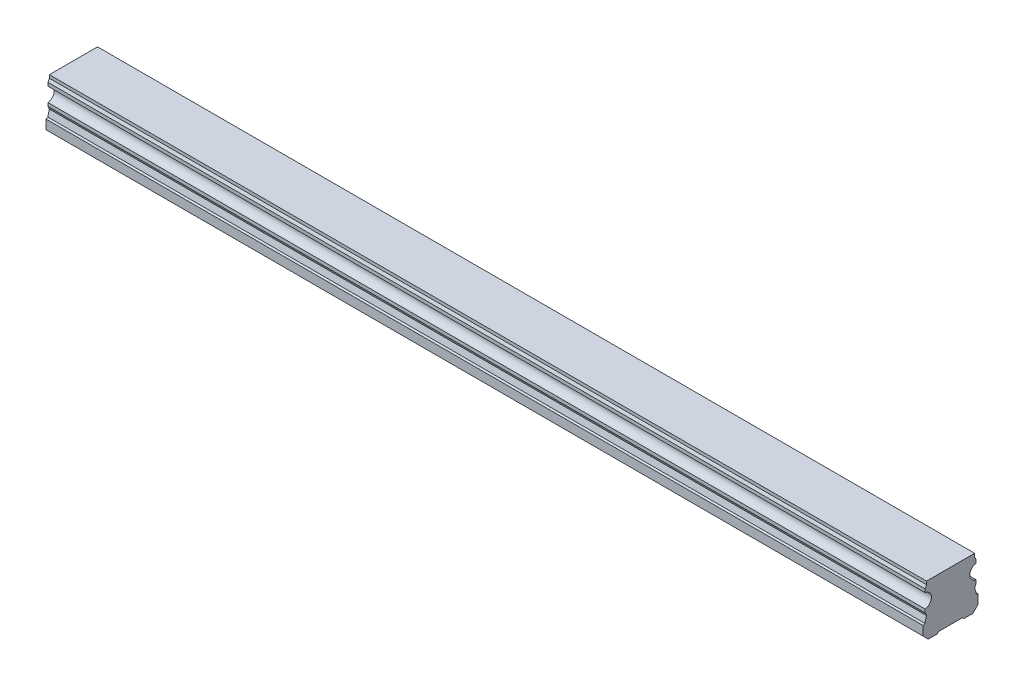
ISO-10303-21;
HEADER;
FILE_DESCRIPTION(('STEP AP214'),'2;1');
FILE_NAME('part.step','',(''),(''),'','','');
FILE_SCHEMA(('AUTOMOTIVE_DESIGN { 1 0 10303 214 1 1 1 1 }'));
ENDSEC;
DATA;
#1=APPLICATION_CONTEXT('core data for automotive mechanical design processes');
#2=APPLICATION_PROTOCOL_DEFINITION('international standard','automotive_design',2000,#1);
#3=PRODUCT_CONTEXT('',#1,'mechanical');
#4=PRODUCT('Part','Part','',(#3));
#5=PRODUCT_RELATED_PRODUCT_CATEGORY('part','',(#4));
#6=PRODUCT_DEFINITION_FORMATION('','',#4);
#7=PRODUCT_DEFINITION_CONTEXT('part definition',#1,'design');
#8=PRODUCT_DEFINITION('design','',#6,#7);
#9=PRODUCT_DEFINITION_SHAPE('','',#8);
#10=(LENGTH_UNIT() NAMED_UNIT(*) SI_UNIT(.MILLI.,.METRE.));
#11=(NAMED_UNIT(*) PLANE_ANGLE_UNIT() SI_UNIT($,.RADIAN.));
#12=(NAMED_UNIT(*) SI_UNIT($,.STERADIAN.) SOLID_ANGLE_UNIT());
#13=UNCERTAINTY_MEASURE_WITH_UNIT(LENGTH_MEASURE(1.E-05),#10,'distance_accuracy_value','');
#14=(GEOMETRIC_REPRESENTATION_CONTEXT(3) GLOBAL_UNCERTAINTY_ASSIGNED_CONTEXT((#13)) GLOBAL_UNIT_ASSIGNED_CONTEXT((#10,
#11,#12)) REPRESENTATION_CONTEXT('',''));
#15=CARTESIAN_POINT('',(0.,0.,0.));
#16=DIRECTION('',(0.,0.,1.));
#17=DIRECTION('',(1.,0.,0.));
#18=AXIS2_PLACEMENT_3D('',#15,#16,#17);
#19=CARTESIAN_POINT('',(210.,0.399999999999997,0.));
#20=DIRECTION('',(0.,-1.,0.));
#21=DIRECTION('',(0.,0.,-1.));
#22=AXIS2_PLACEMENT_3D('',#19,#20,#21);
#23=CONICAL_SURFACE('',#22,2.89999999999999,0.785398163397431);
#24=CARTESIAN_POINT('',(210.,0.799999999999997,0.));
#25=DIRECTION('',(0.,1.,0.));
#26=DIRECTION('',(0.,0.,1.));
#27=AXIS2_PLACEMENT_3D('',#24,#25,#26);
#28=CIRCLE('',#27,2.5);
#29=CARTESIAN_POINT('',(210.,0.799999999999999,2.5));
#30=VERTEX_POINT('',#29);
#31=EDGE_CURVE('E11',#30,#30,#28,.F.);
#32=ORIENTED_EDGE('',*,*,#31,.F.);
#33=EDGE_LOOP('',(#32));
#34=FACE_BOUND('',#33,.T.);
#35=CARTESIAN_POINT('',(210.,0.399999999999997,0.));
#36=DIRECTION('',(0.,1.,0.));
#37=DIRECTION('',(0.,0.,1.));
#38=AXIS2_PLACEMENT_3D('',#35,#36,#37);
#39=CIRCLE('',#38,2.89999999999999);
#40=CARTESIAN_POINT('',(210.,0.399999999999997,2.89999999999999));
#41=VERTEX_POINT('',#40);
#42=EDGE_CURVE('E444',#41,#41,#39,.T.);
#43=ORIENTED_EDGE('',*,*,#42,.F.);
#44=EDGE_LOOP('',(#43));
#45=FACE_BOUND('',#44,.T.);
#46=ADVANCED_FACE('F39',(#34,#45),#23,.F.);
#47=CARTESIAN_POINT('',(210.,7.,0.));
#48=DIRECTION('',(0.,-1.,0.));
#49=DIRECTION('',(0.,0.,-1.));
#50=AXIS2_PLACEMENT_3D('',#47,#48,#49);
#51=CYLINDRICAL_SURFACE('',#50,2.5);
#52=ORIENTED_EDGE('',*,*,#31,.T.);
#53=EDGE_LOOP('',(#52));
#54=FACE_BOUND('',#53,.T.);
#55=CARTESIAN_POINT('',(210.,7.,0.));
#56=DIRECTION('',(0.,-1.,0.));
#57=DIRECTION('',(0.,0.,-1.));
#58=AXIS2_PLACEMENT_3D('',#55,#56,#57);
#59=CIRCLE('',#58,2.5);
#60=CARTESIAN_POINT('',(210.,7.,-2.50000000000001));
#61=VERTEX_POINT('',#60);
#62=EDGE_CURVE('E49',#61,#61,#59,.T.);
#63=ORIENTED_EDGE('',*,*,#62,.F.);
#64=EDGE_LOOP('',(#63));
#65=FACE_BOUND('',#64,.T.);
#66=ADVANCED_FACE('F589',(#54,#65),#51,.F.);
#67=CARTESIAN_POINT('',(210.,7.,0.));
#68=DIRECTION('',(0.,-1.,0.));
#69=DIRECTION('',(0.,0.,-1.));
#70=AXIS2_PLACEMENT_3D('',#67,#68,#69);
#71=PLANE('',#70);
#72=CARTESIAN_POINT('',(210.,7.,0.));
#73=DIRECTION('',(0.,-1.,0.));
#74=DIRECTION('',(0.,0.,-1.));
#75=AXIS2_PLACEMENT_3D('',#72,#73,#74);
#76=CIRCLE('',#75,2.1);
#77=CARTESIAN_POINT('',(210.,7.,-2.1));
#78=VERTEX_POINT('',#77);
#79=EDGE_CURVE('E42',#78,#78,#76,.T.);
#80=ORIENTED_EDGE('',*,*,#79,.F.);
#81=EDGE_LOOP('',(#80));
#82=FACE_BOUND('',#81,.T.);
#83=ORIENTED_EDGE('',*,*,#62,.T.);
#84=EDGE_LOOP('',(#83));
#85=FACE_BOUND('',#84,.T.);
#86=ADVANCED_FACE('F594',(#82,#85),#71,.T.);
#87=CARTESIAN_POINT('',(150.,0.399999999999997,0.));
#88=DIRECTION('',(0.,-1.,0.));
#89=DIRECTION('',(0.,0.,-1.));
#90=AXIS2_PLACEMENT_3D('',#87,#88,#89);
#91=CONICAL_SURFACE('',#90,2.89999999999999,0.785398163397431);
#92=CARTESIAN_POINT('',(150.,0.799999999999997,0.));
#93=DIRECTION('',(0.,1.,0.));
#94=DIRECTION('',(0.,0.,1.));
#95=AXIS2_PLACEMENT_3D('',#92,#93,#94);
#96=CIRCLE('',#95,2.5);
#97=CARTESIAN_POINT('',(150.,0.799999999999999,2.5));
#98=VERTEX_POINT('',#97);
#99=EDGE_CURVE('E440',#98,#98,#96,.F.);
#100=ORIENTED_EDGE('',*,*,#99,.F.);
#101=EDGE_LOOP('',(#100));
#102=FACE_BOUND('',#101,.T.);
#103=CARTESIAN_POINT('',(150.,0.399999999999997,0.));
#104=DIRECTION('',(0.,1.,0.));
#105=DIRECTION('',(0.,0.,1.));
#106=AXIS2_PLACEMENT_3D('',#103,#104,#105);
#107=CIRCLE('',#106,2.89999999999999);
#108=CARTESIAN_POINT('',(150.,0.399999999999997,2.89999999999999));
#109=VERTEX_POINT('',#108);
#110=EDGE_CURVE('E432',#109,#109,#107,.T.);
#111=ORIENTED_EDGE('',*,*,#110,.F.);
#112=EDGE_LOOP('',(#111));
#113=FACE_BOUND('',#112,.T.);
#114=ADVANCED_FACE('F681',(#102,#113),#91,.F.);
#115=CARTESIAN_POINT('',(150.,7.,0.));
#116=DIRECTION('',(0.,-1.,0.));
#117=DIRECTION('',(0.,0.,-1.));
#118=AXIS2_PLACEMENT_3D('',#115,#116,#117);
#119=CYLINDRICAL_SURFACE('',#118,2.5);
#120=ORIENTED_EDGE('',*,*,#99,.T.);
#121=EDGE_LOOP('',(#120));
#122=FACE_BOUND('',#121,.T.);
#123=CARTESIAN_POINT('',(150.,7.,0.));
#124=DIRECTION('',(0.,-1.,0.));
#125=DIRECTION('',(0.,0.,-1.));
#126=AXIS2_PLACEMENT_3D('',#123,#124,#125);
#127=CIRCLE('',#126,2.5);
#128=CARTESIAN_POINT('',(150.,7.,-2.50000000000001));
#129=VERTEX_POINT('',#128);
#130=EDGE_CURVE('E436',#129,#129,#127,.T.);
#131=ORIENTED_EDGE('',*,*,#130,.F.);
#132=EDGE_LOOP('',(#131));
#133=FACE_BOUND('',#132,.T.);
#134=ADVANCED_FACE('F677',(#122,#133),#119,.F.);
#135=CARTESIAN_POINT('',(150.,7.,0.));
#136=DIRECTION('',(0.,-1.,0.));
#137=DIRECTION('',(0.,0.,-1.));
#138=AXIS2_PLACEMENT_3D('',#135,#136,#137);
#139=PLANE('',#138);
#140=CARTESIAN_POINT('',(150.,7.,0.));
#141=DIRECTION('',(0.,-1.,0.));
#142=DIRECTION('',(0.,0.,-1.));
#143=AXIS2_PLACEMENT_3D('',#140,#141,#142);
#144=CIRCLE('',#143,2.1);
#145=CARTESIAN_POINT('',(150.,7.,-2.1));
#146=VERTEX_POINT('',#145);
#147=EDGE_CURVE('E454',#146,#146,#144,.T.);
#148=ORIENTED_EDGE('',*,*,#147,.F.);
#149=EDGE_LOOP('',(#148));
#150=FACE_BOUND('',#149,.T.);
#151=ORIENTED_EDGE('',*,*,#130,.T.);
#152=EDGE_LOOP('',(#151));
#153=FACE_BOUND('',#152,.T.);
#154=ADVANCED_FACE('F667',(#150,#153),#139,.T.);
#155=CARTESIAN_POINT('',(240.,14.,-6.59000000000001));
#156=DIRECTION('',(0.,0.,1.));
#157=DIRECTION('',(0.,-1.,0.));
#158=AXIS2_PLACEMENT_3D('',#155,#156,#157);
#159=PLANE('',#158);
#160=DIRECTION('',(0.,1.,0.));
#161=VECTOR('',#160,1.);
#162=CARTESIAN_POINT('',(0.,14.,-6.59000000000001));
#163=LINE('',#162,#161);
#164=CARTESIAN_POINT('',(0.,13.15,-6.59));
#165=VERTEX_POINT('',#164);
#166=CARTESIAN_POINT('',(0.,14.,-6.59000000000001));
#167=VERTEX_POINT('',#166);
#168=EDGE_CURVE('E255',#165,#167,#163,.T.);
#169=ORIENTED_EDGE('',*,*,#168,.T.);
#170=DIRECTION('',(-1.,0.,0.));
#171=VECTOR('',#170,1.);
#172=CARTESIAN_POINT('',(240.,14.,-6.59000000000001));
#173=LINE('',#172,#171);
#174=CARTESIAN_POINT('',(240.,14.,-6.59000000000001));
#175=VERTEX_POINT('',#174);
#176=EDGE_CURVE('E421',#175,#167,#173,.T.);
#177=ORIENTED_EDGE('',*,*,#176,.F.);
#178=DIRECTION('',(0.,1.,0.));
#179=VECTOR('',#178,1.);
#180=CARTESIAN_POINT('',(240.,14.,-6.59000000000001));
#181=LINE('',#180,#179);
#182=CARTESIAN_POINT('',(240.,13.15,-6.59));
#183=VERTEX_POINT('',#182);
#184=EDGE_CURVE('E331',#183,#175,#181,.T.);
#185=ORIENTED_EDGE('',*,*,#184,.F.);
#186=DIRECTION('',(-1.,0.,0.));
#187=VECTOR('',#186,1.);
#188=CARTESIAN_POINT('',(240.,13.15,-6.59));
#189=LINE('',#188,#187);
#190=EDGE_CURVE('E251',#183,#165,#189,.T.);
#191=ORIENTED_EDGE('',*,*,#190,.T.);
#192=EDGE_LOOP('',(#169,#177,#185,#191));
#193=FACE_BOUND('',#192,.T.);
#194=ADVANCED_FACE('F664',(#193),#159,.F.);
#195=CARTESIAN_POINT('',(240.,14.,-6.59000000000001));
#196=DIRECTION('',(0.,-1.,0.));
#197=DIRECTION('',(0.,0.,-1.));
#198=AXIS2_PLACEMENT_3D('',#195,#196,#197);
#199=PLANE('',#198);
#200=DIRECTION('',(0.,0.,1.));
#201=VECTOR('',#200,1.);
#202=CARTESIAN_POINT('',(0.,14.,-6.59000000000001));
#203=LINE('',#202,#201);
#204=CARTESIAN_POINT('',(0.,14.,6.59));
#205=VERTEX_POINT('',#204);
#206=EDGE_CURVE('E259',#167,#205,#203,.T.);
#207=ORIENTED_EDGE('',*,*,#206,.T.);
#208=DIRECTION('',(-1.,0.,0.));
#209=VECTOR('',#208,1.);
#210=CARTESIAN_POINT('',(240.,14.,6.59));
#211=LINE('',#210,#209);
#212=CARTESIAN_POINT('',(240.,14.,6.59));
#213=VERTEX_POINT('',#212);
#214=EDGE_CURVE('E417',#213,#205,#211,.T.);
#215=ORIENTED_EDGE('',*,*,#214,.F.);
#216=DIRECTION('',(0.,0.,1.));
#217=VECTOR('',#216,1.);
#218=CARTESIAN_POINT('',(240.,14.,-6.59000000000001));
#219=LINE('',#218,#217);
#220=EDGE_CURVE('E157',#175,#213,#219,.T.);
#221=ORIENTED_EDGE('',*,*,#220,.F.);
#222=ORIENTED_EDGE('',*,*,#176,.T.);
#223=EDGE_LOOP('',(#207,#215,#221,#222));
#224=FACE_BOUND('',#223,.T.);
#225=ADVANCED_FACE('F660',(#224),#199,.F.);
#226=CARTESIAN_POINT('',(240.,14.,6.59));
#227=DIRECTION('',(0.,0.,-1.));
#228=DIRECTION('',(0.,1.,0.));
#229=AXIS2_PLACEMENT_3D('',#226,#227,#228);
#230=PLANE('',#229);
#231=DIRECTION('',(0.,-1.,0.));
#232=VECTOR('',#231,1.);
#233=CARTESIAN_POINT('',(0.,14.,6.59));
#234=LINE('',#233,#232);
#235=CARTESIAN_POINT('',(0.,13.15,6.59));
#236=VERTEX_POINT('',#235);
#237=EDGE_CURVE('E262',#205,#236,#234,.T.);
#238=ORIENTED_EDGE('',*,*,#237,.T.);
#239=DIRECTION('',(-1.,0.,0.));
#240=VECTOR('',#239,1.);
#241=CARTESIAN_POINT('',(240.,13.15,6.59));
#242=LINE('',#241,#240);
#243=CARTESIAN_POINT('',(240.,13.15,6.59));
#244=VERTEX_POINT('',#243);
#245=EDGE_CURVE('E413',#244,#236,#242,.T.);
#246=ORIENTED_EDGE('',*,*,#245,.F.);
#247=DIRECTION('',(0.,-1.,0.));
#248=VECTOR('',#247,1.);
#249=CARTESIAN_POINT('',(240.,14.,6.59));
#250=LINE('',#249,#248);
#251=EDGE_CURVE('E497',#213,#244,#250,.T.);
#252=ORIENTED_EDGE('',*,*,#251,.F.);
#253=ORIENTED_EDGE('',*,*,#214,.T.);
#254=EDGE_LOOP('',(#238,#246,#252,#253));
#255=FACE_BOUND('',#254,.T.);
#256=ADVANCED_FACE('F656',(#255),#230,.F.);
#257=CARTESIAN_POINT('',(240.,13.15,6.59));
#258=DIRECTION('',(0.,-0.422618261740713,-0.906307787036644));
#259=DIRECTION('',(0.,0.906307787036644,-0.422618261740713));
#260=AXIS2_PLACEMENT_3D('',#257,#258,#259);
#261=PLANE('',#260);
#262=DIRECTION('',(0.,-0.906307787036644,0.422618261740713));
#263=VECTOR('',#262,1.);
#264=CARTESIAN_POINT('',(0.,13.15,6.59));
#265=LINE('',#264,#263);
#266=CARTESIAN_POINT('',(0.,12.3565324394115,6.96));
#267=VERTEX_POINT('',#266);
#268=EDGE_CURVE('E265',#236,#267,#265,.T.);
#269=ORIENTED_EDGE('',*,*,#268,.T.);
#270=DIRECTION('',(-1.,0.,0.));
#271=VECTOR('',#270,1.);
#272=CARTESIAN_POINT('',(240.,12.3565324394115,6.96));
#273=LINE('',#272,#271);
#274=CARTESIAN_POINT('',(240.,12.3565324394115,6.96));
#275=VERTEX_POINT('',#274);
#276=EDGE_CURVE('E409',#275,#267,#273,.T.);
#277=ORIENTED_EDGE('',*,*,#276,.F.);
#278=DIRECTION('',(0.,-0.906307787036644,0.422618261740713));
#279=VECTOR('',#278,1.);
#280=CARTESIAN_POINT('',(240.,13.15,6.59));
#281=LINE('',#280,#279);
#282=EDGE_CURVE('E500',#244,#275,#281,.T.);
#283=ORIENTED_EDGE('',*,*,#282,.F.);
#284=ORIENTED_EDGE('',*,*,#245,.T.);
#285=EDGE_LOOP('',(#269,#277,#283,#284));
#286=FACE_BOUND('',#285,.T.);
#287=ADVANCED_FACE('F652',(#286),#261,.F.);
#288=CARTESIAN_POINT('',(240.,12.3565324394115,6.96));
#289=DIRECTION('',(0.,0.,-1.));
#290=DIRECTION('',(0.,1.,0.));
#291=AXIS2_PLACEMENT_3D('',#288,#289,#290);
#292=PLANE('',#291);
#293=DIRECTION('',(0.,-1.,0.));
#294=VECTOR('',#293,1.);
#295=CARTESIAN_POINT('',(0.,12.3565324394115,6.96));
#296=LINE('',#295,#294);
#297=CARTESIAN_POINT('',(0.,11.4351744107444,6.96));
#298=VERTEX_POINT('',#297);
#299=EDGE_CURVE('E268',#267,#298,#296,.T.);
#300=ORIENTED_EDGE('',*,*,#299,.T.);
#301=DIRECTION('',(-1.,0.,0.));
#302=VECTOR('',#301,1.);
#303=CARTESIAN_POINT('',(240.,11.4351744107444,6.96));
#304=LINE('',#303,#302);
#305=CARTESIAN_POINT('',(240.,11.4351744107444,6.96));
#306=VERTEX_POINT('',#305);
#307=EDGE_CURVE('E405',#306,#298,#304,.T.);
#308=ORIENTED_EDGE('',*,*,#307,.F.);
#309=DIRECTION('',(0.,-1.,0.));
#310=VECTOR('',#309,1.);
#311=CARTESIAN_POINT('',(240.,12.3565324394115,6.96));
#312=LINE('',#311,#310);
#313=EDGE_CURVE('E503',#275,#306,#312,.T.);
#314=ORIENTED_EDGE('',*,*,#313,.F.);
#315=ORIENTED_EDGE('',*,*,#276,.T.);
#316=EDGE_LOOP('',(#300,#308,#314,#315));
#317=FACE_BOUND('',#316,.T.);
#318=ADVANCED_FACE('F648',(#317),#292,.F.);
#319=CARTESIAN_POINT('',(240.,9.5,7.2));
#320=DIRECTION('',(-1.,0.,0.));
#321=DIRECTION('',(0.,0.,1.));
#322=AXIS2_PLACEMENT_3D('',#319,#320,#321);
#323=CYLINDRICAL_SURFACE('',#322,1.95);
#324=CARTESIAN_POINT('',(0.,9.5,7.2));
#325=DIRECTION('',(-1.,0.,0.));
#326=DIRECTION('',(0.,0.,-1.));
#327=AXIS2_PLACEMENT_3D('',#324,#325,#326);
#328=CIRCLE('',#327,1.95);
#329=CARTESIAN_POINT('',(0.,7.56482558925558,6.96));
#330=VERTEX_POINT('',#329);
#331=EDGE_CURVE('E271',#298,#330,#328,.T.);
#332=ORIENTED_EDGE('',*,*,#331,.T.);
#333=DIRECTION('',(-1.,0.,0.));
#334=VECTOR('',#333,1.);
#335=CARTESIAN_POINT('',(240.,7.56482558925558,6.96));
#336=LINE('',#335,#334);
#337=CARTESIAN_POINT('',(240.,7.56482558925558,6.96));
#338=VERTEX_POINT('',#337);
#339=EDGE_CURVE('E401',#338,#330,#336,.T.);
#340=ORIENTED_EDGE('',*,*,#339,.F.);
#341=CARTESIAN_POINT('',(240.,9.5,7.2));
#342=DIRECTION('',(-1.,0.,0.));
#343=DIRECTION('',(0.,0.,-1.));
#344=AXIS2_PLACEMENT_3D('',#341,#342,#343);
#345=CIRCLE('',#344,1.95);
#346=EDGE_CURVE('E506',#306,#338,#345,.T.);
#347=ORIENTED_EDGE('',*,*,#346,.F.);
#348=ORIENTED_EDGE('',*,*,#307,.T.);
#349=EDGE_LOOP('',(#332,#340,#347,#348));
#350=FACE_BOUND('',#349,.T.);
#351=ADVANCED_FACE('F644',(#350),#323,.F.);
#352=CARTESIAN_POINT('',(240.,7.56482558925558,6.96));
#353=DIRECTION('',(0.,0.,-1.));
#354=DIRECTION('',(0.,1.,0.));
#355=AXIS2_PLACEMENT_3D('',#352,#353,#354);
#356=PLANE('',#355);
#357=DIRECTION('',(0.,-1.,0.));
#358=VECTOR('',#357,1.);
#359=CARTESIAN_POINT('',(0.,7.56482558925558,6.96));
#360=LINE('',#359,#358);
#361=CARTESIAN_POINT('',(0.,6.64346756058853,6.96));
#362=VERTEX_POINT('',#361);
#363=EDGE_CURVE('E274',#330,#362,#360,.T.);
#364=ORIENTED_EDGE('',*,*,#363,.T.);
#365=DIRECTION('',(-1.,0.,0.));
#366=VECTOR('',#365,1.);
#367=CARTESIAN_POINT('',(240.,6.64346756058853,6.96));
#368=LINE('',#367,#366);
#369=CARTESIAN_POINT('',(240.,6.64346756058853,6.96));
#370=VERTEX_POINT('',#369);
#371=EDGE_CURVE('E397',#370,#362,#368,.T.);
#372=ORIENTED_EDGE('',*,*,#371,.F.);
#373=DIRECTION('',(0.,-1.,0.));
#374=VECTOR('',#373,1.);
#375=CARTESIAN_POINT('',(240.,7.56482558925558,6.96));
#376=LINE('',#375,#374);
#377=EDGE_CURVE('E509',#338,#370,#376,.T.);
#378=ORIENTED_EDGE('',*,*,#377,.F.);
#379=ORIENTED_EDGE('',*,*,#339,.T.);
#380=EDGE_LOOP('',(#364,#372,#378,#379));
#381=FACE_BOUND('',#380,.T.);
#382=ADVANCED_FACE('F640',(#381),#356,.F.);
#383=CARTESIAN_POINT('',(240.,6.64346756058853,6.96));
#384=DIRECTION('',(0.,0.422618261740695,-0.906307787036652));
#385=DIRECTION('',(0.,0.906307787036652,0.422618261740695));
#386=AXIS2_PLACEMENT_3D('',#383,#384,#385);
#387=PLANE('',#386);
#388=DIRECTION('',(0.,-0.906307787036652,-0.422618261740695));
#389=VECTOR('',#388,1.);
#390=CARTESIAN_POINT('',(0.,6.64346756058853,6.96));
#391=LINE('',#390,#389);
#392=CARTESIAN_POINT('',(0.,5.85,6.59000000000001));
#393=VERTEX_POINT('',#392);
#394=EDGE_CURVE('E277',#362,#393,#391,.T.);
#395=ORIENTED_EDGE('',*,*,#394,.T.);
#396=DIRECTION('',(-1.,0.,0.));
#397=VECTOR('',#396,1.);
#398=CARTESIAN_POINT('',(240.,5.85,6.59000000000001));
#399=LINE('',#398,#397);
#400=CARTESIAN_POINT('',(240.,5.85,6.59000000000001));
#401=VERTEX_POINT('',#400);
#402=EDGE_CURVE('E393',#401,#393,#399,.T.);
#403=ORIENTED_EDGE('',*,*,#402,.F.);
#404=DIRECTION('',(0.,-0.906307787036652,-0.422618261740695));
#405=VECTOR('',#404,1.);
#406=CARTESIAN_POINT('',(240.,6.64346756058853,6.96));
#407=LINE('',#406,#405);
#408=EDGE_CURVE('E512',#370,#401,#407,.T.);
#409=ORIENTED_EDGE('',*,*,#408,.F.);
#410=ORIENTED_EDGE('',*,*,#371,.T.);
#411=EDGE_LOOP('',(#395,#403,#409,#410));
#412=FACE_BOUND('',#411,.T.);
#413=ADVANCED_FACE('F636',(#412),#387,.F.);
#414=CARTESIAN_POINT('',(240.,5.85,6.59000000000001));
#415=DIRECTION('',(0.,-0.25881904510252,-0.965925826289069));
#416=DIRECTION('',(0.,0.965925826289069,-0.25881904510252));
#417=AXIS2_PLACEMENT_3D('',#414,#415,#416);
#418=PLANE('',#417);
#419=DIRECTION('',(0.,-0.965925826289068,0.25881904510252));
#420=VECTOR('',#419,1.);
#421=CARTESIAN_POINT('',(0.,5.85,6.59000000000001));
#422=LINE('',#421,#420);
#423=CARTESIAN_POINT('',(0.,4.2,7.03211616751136));
#424=VERTEX_POINT('',#423);
#425=EDGE_CURVE('E280',#393,#424,#422,.T.);
#426=ORIENTED_EDGE('',*,*,#425,.T.);
#427=DIRECTION('',(-1.,0.,0.));
#428=VECTOR('',#427,1.);
#429=CARTESIAN_POINT('',(240.,4.2,7.03211616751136));
#430=LINE('',#429,#428);
#431=CARTESIAN_POINT('',(240.,4.2,7.03211616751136));
#432=VERTEX_POINT('',#431);
#433=EDGE_CURVE('E389',#432,#424,#430,.T.);
#434=ORIENTED_EDGE('',*,*,#433,.F.);
#435=DIRECTION('',(0.,-0.965925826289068,0.25881904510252));
#436=VECTOR('',#435,1.);
#437=CARTESIAN_POINT('',(240.,5.85,6.59000000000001));
#438=LINE('',#437,#436);
#439=EDGE_CURVE('E515',#401,#432,#438,.T.);
#440=ORIENTED_EDGE('',*,*,#439,.F.);
#441=ORIENTED_EDGE('',*,*,#402,.T.);
#442=EDGE_LOOP('',(#426,#434,#440,#441));
#443=FACE_BOUND('',#442,.T.);
#444=ADVANCED_FACE('F632',(#443),#418,.F.);
#445=CARTESIAN_POINT('',(240.,4.2,7.03211616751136));
#446=DIRECTION('',(0.,-0.866025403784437,-0.500000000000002));
#447=DIRECTION('',(0.,0.500000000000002,-0.866025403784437));
#448=AXIS2_PLACEMENT_3D('',#445,#446,#447);
#449=PLANE('',#448);
#450=DIRECTION('',(0.,-0.500000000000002,0.866025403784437));
#451=VECTOR('',#450,1.);
#452=CARTESIAN_POINT('',(0.,4.2,7.03211616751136));
#453=LINE('',#452,#451);
#454=CARTESIAN_POINT('',(0.,3.92986714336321,7.5));
#455=VERTEX_POINT('',#454);
#456=EDGE_CURVE('E283',#424,#455,#453,.T.);
#457=ORIENTED_EDGE('',*,*,#456,.T.);
#458=DIRECTION('',(-1.,0.,0.));
#459=VECTOR('',#458,1.);
#460=CARTESIAN_POINT('',(240.,3.92986714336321,7.5));
#461=LINE('',#460,#459);
#462=CARTESIAN_POINT('',(240.,3.92986714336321,7.5));
#463=VERTEX_POINT('',#462);
#464=EDGE_CURVE('E385',#463,#455,#461,.T.);
#465=ORIENTED_EDGE('',*,*,#464,.F.);
#466=DIRECTION('',(0.,-0.500000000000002,0.866025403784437));
#467=VECTOR('',#466,1.);
#468=CARTESIAN_POINT('',(240.,4.2,7.03211616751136));
#469=LINE('',#468,#467);
#470=EDGE_CURVE('E518',#432,#463,#469,.T.);
#471=ORIENTED_EDGE('',*,*,#470,.F.);
#472=ORIENTED_EDGE('',*,*,#433,.T.);
#473=EDGE_LOOP('',(#457,#465,#471,#472));
#474=FACE_BOUND('',#473,.T.);
#475=ADVANCED_FACE('F628',(#474),#449,.F.);
#476=CARTESIAN_POINT('',(240.,3.92986714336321,7.5));
#477=DIRECTION('',(0.,0.,-1.));
#478=DIRECTION('',(0.,1.,0.));
#479=AXIS2_PLACEMENT_3D('',#476,#477,#478);
#480=PLANE('',#479);
#481=DIRECTION('',(0.,-1.,0.));
#482=VECTOR('',#481,1.);
#483=CARTESIAN_POINT('',(0.,3.92986714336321,7.5));
#484=LINE('',#483,#482);
#485=CARTESIAN_POINT('',(0.,1.4,7.5));
#486=VERTEX_POINT('',#485);
#487=EDGE_CURVE('E286',#455,#486,#484,.T.);
#488=ORIENTED_EDGE('',*,*,#487,.T.);
#489=DIRECTION('',(-1.,0.,0.));
#490=VECTOR('',#489,1.);
#491=CARTESIAN_POINT('',(240.,1.4,7.5));
#492=LINE('',#491,#490);
#493=CARTESIAN_POINT('',(240.,1.4,7.5));
#494=VERTEX_POINT('',#493);
#495=EDGE_CURVE('E381',#494,#486,#492,.T.);
#496=ORIENTED_EDGE('',*,*,#495,.F.);
#497=DIRECTION('',(0.,-1.,0.));
#498=VECTOR('',#497,1.);
#499=CARTESIAN_POINT('',(240.,3.92986714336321,7.5));
#500=LINE('',#499,#498);
#501=EDGE_CURVE('E521',#463,#494,#500,.T.);
#502=ORIENTED_EDGE('',*,*,#501,.F.);
#503=ORIENTED_EDGE('',*,*,#464,.T.);
#504=EDGE_LOOP('',(#488,#496,#502,#503));
#505=FACE_BOUND('',#504,.T.);
#506=ADVANCED_FACE('F624',(#505),#480,.F.);
#507=CARTESIAN_POINT('',(240.,1.4,7.5));
#508=DIRECTION('',(0.,0.70710678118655,-0.707106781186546));
#509=DIRECTION('',(0.,0.707106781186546,0.70710678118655));
#510=AXIS2_PLACEMENT_3D('',#507,#508,#509);
#511=PLANE('',#510);
#512=DIRECTION('',(0.,-0.707106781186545,-0.70710678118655));
#513=VECTOR('',#512,1.);
#514=CARTESIAN_POINT('',(0.,1.4,7.5));
#515=LINE('',#514,#513);
#516=CARTESIAN_POINT('',(0.,0.,6.1));
#517=VERTEX_POINT('',#516);
#518=EDGE_CURVE('E289',#486,#517,#515,.T.);
#519=ORIENTED_EDGE('',*,*,#518,.T.);
#520=DIRECTION('',(-1.,0.,0.));
#521=VECTOR('',#520,1.);
#522=CARTESIAN_POINT('',(240.,0.,6.1));
#523=LINE('',#522,#521);
#524=CARTESIAN_POINT('',(240.,0.,6.1));
#525=VERTEX_POINT('',#524);
#526=EDGE_CURVE('E377',#525,#517,#523,.T.);
#527=ORIENTED_EDGE('',*,*,#526,.F.);
#528=DIRECTION('',(0.,-0.707106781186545,-0.70710678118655));
#529=VECTOR('',#528,1.);
#530=CARTESIAN_POINT('',(240.,1.4,7.5));
#531=LINE('',#530,#529);
#532=EDGE_CURVE('E524',#494,#525,#531,.T.);
#533=ORIENTED_EDGE('',*,*,#532,.F.);
#534=ORIENTED_EDGE('',*,*,#495,.T.);
#535=EDGE_LOOP('',(#519,#527,#533,#534));
#536=FACE_BOUND('',#535,.T.);
#537=ADVANCED_FACE('F620',(#536),#511,.F.);
#538=CARTESIAN_POINT('',(240.,0.,6.1));
#539=DIRECTION('',(0.,1.,0.));
#540=DIRECTION('',(0.,0.,1.));
#541=AXIS2_PLACEMENT_3D('',#538,#539,#540);
#542=PLANE('',#541);
#543=DIRECTION('',(0.,0.,-1.));
#544=VECTOR('',#543,1.);
#545=CARTESIAN_POINT('',(0.,0.,6.1));
#546=LINE('',#545,#544);
#547=CARTESIAN_POINT('',(0.,0.,3.65));
#548=VERTEX_POINT('',#547);
#549=EDGE_CURVE('E292',#517,#548,#546,.T.);
#550=ORIENTED_EDGE('',*,*,#549,.T.);
#551=DIRECTION('',(-1.,0.,0.));
#552=VECTOR('',#551,1.);
#553=CARTESIAN_POINT('',(240.,0.,3.65));
#554=LINE('',#553,#552);
#555=CARTESIAN_POINT('',(240.,0.,3.65));
#556=VERTEX_POINT('',#555);
#557=EDGE_CURVE('E373',#556,#548,#554,.T.);
#558=ORIENTED_EDGE('',*,*,#557,.F.);
#559=DIRECTION('',(0.,0.,-1.));
#560=VECTOR('',#559,1.);
#561=CARTESIAN_POINT('',(240.,0.,6.1));
#562=LINE('',#561,#560);
#563=EDGE_CURVE('E527',#525,#556,#562,.T.);
#564=ORIENTED_EDGE('',*,*,#563,.F.);
#565=ORIENTED_EDGE('',*,*,#526,.T.);
#566=EDGE_LOOP('',(#550,#558,#564,#565));
#567=FACE_BOUND('',#566,.T.);
#568=ADVANCED_FACE('F612',(#567),#542,.F.);
#569=CARTESIAN_POINT('',(240.,0.,3.65));
#570=DIRECTION('',(0.,0.707106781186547,0.707106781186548));
#571=DIRECTION('',(0.,-0.707106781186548,0.707106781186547));
#572=AXIS2_PLACEMENT_3D('',#569,#570,#571);
#573=PLANE('',#572);
#574=DIRECTION('',(0.,0.707106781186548,-0.707106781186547));
#575=VECTOR('',#574,1.);
#576=CARTESIAN_POINT('',(0.,0.,3.65));
#577=LINE('',#576,#575);
#578=CARTESIAN_POINT('',(0.,0.399999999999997,3.25));
#579=VERTEX_POINT('',#578);
#580=EDGE_CURVE('E295',#548,#579,#577,.T.);
#581=ORIENTED_EDGE('',*,*,#580,.T.);
#582=DIRECTION('',(-1.,0.,0.));
#583=VECTOR('',#582,1.);
#584=CARTESIAN_POINT('',(240.,0.399999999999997,3.25));
#585=LINE('',#584,#583);
#586=CARTESIAN_POINT('',(240.,0.399999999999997,3.25));
#587=VERTEX_POINT('',#586);
#588=EDGE_CURVE('E370',#587,#579,#585,.T.);
#589=ORIENTED_EDGE('',*,*,#588,.F.);
#590=DIRECTION('',(0.,0.707106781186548,-0.707106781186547));
#591=VECTOR('',#590,1.);
#592=CARTESIAN_POINT('',(240.,0.,3.65));
#593=LINE('',#592,#591);
#594=EDGE_CURVE('E530',#556,#587,#593,.T.);
#595=ORIENTED_EDGE('',*,*,#594,.F.);
#596=ORIENTED_EDGE('',*,*,#557,.T.);
#597=EDGE_LOOP('',(#581,#589,#595,#596));
#598=FACE_BOUND('',#597,.T.);
#599=ADVANCED_FACE('F603',(#598),#573,.F.);
#600=CARTESIAN_POINT('',(240.,0.399999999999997,3.25));
#601=DIRECTION('',(0.,1.,0.));
#602=DIRECTION('',(0.,0.,1.));
#603=AXIS2_PLACEMENT_3D('',#600,#601,#602);
#604=PLANE('',#603);
#605=CARTESIAN_POINT('',(90.,0.399999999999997,0.));
#606=DIRECTION('',(0.,1.,0.));
#607=DIRECTION('',(0.,0.,1.));
#608=AXIS2_PLACEMENT_3D('',#605,#606,#607);
#609=CIRCLE('',#608,2.89999999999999);
#610=CARTESIAN_POINT('',(90.,0.399999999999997,2.89999999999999));
#611=VERTEX_POINT('',#610);
#612=EDGE_CURVE('E462',#611,#611,#609,.T.);
#613=ORIENTED_EDGE('',*,*,#612,.T.);
#614=EDGE_LOOP('',(#613));
#615=FACE_BOUND('',#614,.T.);
#616=CARTESIAN_POINT('',(30.,0.399999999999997,0.));
#617=DIRECTION('',(0.,1.,0.));
#618=DIRECTION('',(0.,0.,1.));
#619=AXIS2_PLACEMENT_3D('',#616,#617,#618);
#620=CIRCLE('',#619,2.89999999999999);
#621=CARTESIAN_POINT('',(30.,0.399999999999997,2.89999999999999));
#622=VERTEX_POINT('',#621);
#623=EDGE_CURVE('E424',#622,#622,#620,.T.);
#624=ORIENTED_EDGE('',*,*,#623,.T.);
#625=EDGE_LOOP('',(#624));
#626=FACE_BOUND('',#625,.T.);
#627=DIRECTION('',(0.,0.,-1.));
#628=VECTOR('',#627,1.);
#629=CARTESIAN_POINT('',(0.,0.399999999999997,3.25));
#630=LINE('',#629,#628);
#631=CARTESIAN_POINT('',(0.,0.399999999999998,-3.25));
#632=VERTEX_POINT('',#631);
#633=EDGE_CURVE('E298',#579,#632,#630,.T.);
#634=ORIENTED_EDGE('',*,*,#633,.T.);
#635=DIRECTION('',(-1.,0.,0.));
#636=VECTOR('',#635,1.);
#637=CARTESIAN_POINT('',(240.,0.399999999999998,-3.25));
#638=LINE('',#637,#636);
#639=CARTESIAN_POINT('',(240.,0.399999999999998,-3.25));
#640=VERTEX_POINT('',#639);
#641=EDGE_CURVE('E366',#640,#632,#638,.T.);
#642=ORIENTED_EDGE('',*,*,#641,.F.);
#643=DIRECTION('',(0.,0.,-1.));
#644=VECTOR('',#643,1.);
#645=CARTESIAN_POINT('',(240.,0.399999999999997,3.25));
#646=LINE('',#645,#644);
#647=EDGE_CURVE('E533',#587,#640,#646,.T.);
#648=ORIENTED_EDGE('',*,*,#647,.F.);
#649=ORIENTED_EDGE('',*,*,#588,.T.);
#650=EDGE_LOOP('',(#634,#642,#648,#649));
#651=FACE_BOUND('',#650,.T.);
#652=ORIENTED_EDGE('',*,*,#110,.T.);
#653=EDGE_LOOP('',(#652));
#654=FACE_BOUND('',#653,.T.);
#655=ORIENTED_EDGE('',*,*,#42,.T.);
#656=EDGE_LOOP('',(#655));
#657=FACE_BOUND('',#656,.T.);
#658=ADVANCED_FACE('F600',(#615,#626,#651,#654,#657),#604,.F.);
#659=CARTESIAN_POINT('',(240.,0.399999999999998,-3.25));
#660=DIRECTION('',(0.,0.707106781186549,-0.707106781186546));
#661=DIRECTION('',(0.,0.707106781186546,0.707106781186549));
#662=AXIS2_PLACEMENT_3D('',#659,#660,#661);
#663=PLANE('',#662);
#664=DIRECTION('',(0.,-0.707106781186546,-0.707106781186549));
#665=VECTOR('',#664,1.);
#666=CARTESIAN_POINT('',(0.,0.399999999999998,-3.25));
#667=LINE('',#666,#665);
#668=CARTESIAN_POINT('',(0.,0.,-3.65));
#669=VERTEX_POINT('',#668);
#670=EDGE_CURVE('E301',#632,#669,#667,.T.);
#671=ORIENTED_EDGE('',*,*,#670,.T.);
#672=DIRECTION('',(-1.,0.,0.));
#673=VECTOR('',#672,1.);
#674=CARTESIAN_POINT('',(240.,0.,-3.65));
#675=LINE('',#674,#673);
#676=CARTESIAN_POINT('',(240.,0.,-3.65));
#677=VERTEX_POINT('',#676);
#678=EDGE_CURVE('E362',#677,#669,#675,.T.);
#679=ORIENTED_EDGE('',*,*,#678,.F.);
#680=DIRECTION('',(0.,-0.707106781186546,-0.707106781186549));
#681=VECTOR('',#680,1.);
#682=CARTESIAN_POINT('',(240.,0.399999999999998,-3.25));
#683=LINE('',#682,#681);
#684=EDGE_CURVE('E536',#640,#677,#683,.T.);
#685=ORIENTED_EDGE('',*,*,#684,.F.);
#686=ORIENTED_EDGE('',*,*,#641,.T.);
#687=EDGE_LOOP('',(#671,#679,#685,#686));
#688=FACE_BOUND('',#687,.T.);
#689=ADVANCED_FACE('F602',(#688),#663,.F.);
#690=CARTESIAN_POINT('',(240.,0.,-3.65));
#691=DIRECTION('',(0.,1.,0.));
#692=DIRECTION('',(0.,0.,1.));
#693=AXIS2_PLACEMENT_3D('',#690,#691,#692);
#694=PLANE('',#693);
#695=DIRECTION('',(0.,0.,-1.));
#696=VECTOR('',#695,1.);
#697=CARTESIAN_POINT('',(0.,0.,-3.65));
#698=LINE('',#697,#696);
#699=CARTESIAN_POINT('',(0.,0.,-6.1));
#700=VERTEX_POINT('',#699);
#701=EDGE_CURVE('E304',#669,#700,#698,.T.);
#702=ORIENTED_EDGE('',*,*,#701,.T.);
#703=DIRECTION('',(-1.,0.,0.));
#704=VECTOR('',#703,1.);
#705=CARTESIAN_POINT('',(240.,0.,-6.1));
#706=LINE('',#705,#704);
#707=CARTESIAN_POINT('',(240.,0.,-6.1));
#708=VERTEX_POINT('',#707);
#709=EDGE_CURVE('E358',#708,#700,#706,.T.);
#710=ORIENTED_EDGE('',*,*,#709,.F.);
#711=DIRECTION('',(0.,0.,-1.));
#712=VECTOR('',#711,1.);
#713=CARTESIAN_POINT('',(240.,0.,-3.65));
#714=LINE('',#713,#712);
#715=EDGE_CURVE('E539',#677,#708,#714,.T.);
#716=ORIENTED_EDGE('',*,*,#715,.F.);
#717=ORIENTED_EDGE('',*,*,#678,.T.);
#718=EDGE_LOOP('',(#702,#710,#716,#717));
#719=FACE_BOUND('',#718,.T.);
#720=ADVANCED_FACE('F609',(#719),#694,.F.);
#721=CARTESIAN_POINT('',(240.,0.,-6.1));
#722=DIRECTION('',(0.,0.707106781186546,0.707106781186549));
#723=DIRECTION('',(0.,-0.707106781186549,0.707106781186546));
#724=AXIS2_PLACEMENT_3D('',#721,#722,#723);
#725=PLANE('',#724);
#726=DIRECTION('',(0.,0.707106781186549,-0.707106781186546));
#727=VECTOR('',#726,1.);
#728=CARTESIAN_POINT('',(0.,0.,-6.1));
#729=LINE('',#728,#727);
#730=CARTESIAN_POINT('',(0.,1.4,-7.5));
#731=VERTEX_POINT('',#730);
#732=EDGE_CURVE('E307',#700,#731,#729,.T.);
#733=ORIENTED_EDGE('',*,*,#732,.T.);
#734=DIRECTION('',(-1.,0.,0.));
#735=VECTOR('',#734,1.);
#736=CARTESIAN_POINT('',(240.,1.4,-7.5));
#737=LINE('',#736,#735);
#738=CARTESIAN_POINT('',(240.,1.4,-7.5));
#739=VERTEX_POINT('',#738);
#740=EDGE_CURVE('E354',#739,#731,#737,.T.);
#741=ORIENTED_EDGE('',*,*,#740,.F.);
#742=DIRECTION('',(0.,0.707106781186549,-0.707106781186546));
#743=VECTOR('',#742,1.);
#744=CARTESIAN_POINT('',(240.,0.,-6.1));
#745=LINE('',#744,#743);
#746=EDGE_CURVE('E542',#708,#739,#745,.T.);
#747=ORIENTED_EDGE('',*,*,#746,.F.);
#748=ORIENTED_EDGE('',*,*,#709,.T.);
#749=EDGE_LOOP('',(#733,#741,#747,#748));
#750=FACE_BOUND('',#749,.T.);
#751=ADVANCED_FACE('F762',(#750),#725,.F.);
#752=CARTESIAN_POINT('',(240.,1.4,-7.5));
#753=DIRECTION('',(0.,0.,1.));
#754=DIRECTION('',(0.,-1.,0.));
#755=AXIS2_PLACEMENT_3D('',#752,#753,#754);
#756=PLANE('',#755);
#757=DIRECTION('',(0.,1.,0.));
#758=VECTOR('',#757,1.);
#759=CARTESIAN_POINT('',(0.,1.4,-7.5));
#760=LINE('',#759,#758);
#761=CARTESIAN_POINT('',(0.,3.92986714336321,-7.5));
#762=VERTEX_POINT('',#761);
#763=EDGE_CURVE('E310',#731,#762,#760,.T.);
#764=ORIENTED_EDGE('',*,*,#763,.T.);
#765=DIRECTION('',(-1.,0.,0.));
#766=VECTOR('',#765,1.);
#767=CARTESIAN_POINT('',(240.,3.92986714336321,-7.5));
#768=LINE('',#767,#766);
#769=CARTESIAN_POINT('',(240.,3.92986714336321,-7.5));
#770=VERTEX_POINT('',#769);
#771=EDGE_CURVE('E350',#770,#762,#768,.T.);
#772=ORIENTED_EDGE('',*,*,#771,.F.);
#773=DIRECTION('',(0.,1.,0.));
#774=VECTOR('',#773,1.);
#775=CARTESIAN_POINT('',(240.,1.4,-7.5));
#776=LINE('',#775,#774);
#777=EDGE_CURVE('E545',#739,#770,#776,.T.);
#778=ORIENTED_EDGE('',*,*,#777,.F.);
#779=ORIENTED_EDGE('',*,*,#740,.T.);
#780=EDGE_LOOP('',(#764,#772,#778,#779));
#781=FACE_BOUND('',#780,.T.);
#782=ADVANCED_FACE('F770',(#781),#756,.F.);
#783=CARTESIAN_POINT('',(240.,3.92986714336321,-7.5));
#784=DIRECTION('',(0.,-0.866025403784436,0.500000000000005));
#785=DIRECTION('',(0.,-0.500000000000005,-0.866025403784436));
#786=AXIS2_PLACEMENT_3D('',#783,#784,#785);
#787=PLANE('',#786);
#788=DIRECTION('',(0.,0.500000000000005,0.866025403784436));
#789=VECTOR('',#788,1.);
#790=CARTESIAN_POINT('',(0.,3.92986714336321,-7.5));
#791=LINE('',#790,#789);
#792=CARTESIAN_POINT('',(0.,4.2,-7.03211616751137));
#793=VERTEX_POINT('',#792);
#794=EDGE_CURVE('E313',#762,#793,#791,.T.);
#795=ORIENTED_EDGE('',*,*,#794,.T.);
#796=DIRECTION('',(-1.,0.,0.));
#797=VECTOR('',#796,1.);
#798=CARTESIAN_POINT('',(240.,4.2,-7.03211616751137));
#799=LINE('',#798,#797);
#800=CARTESIAN_POINT('',(240.,4.2,-7.03211616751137));
#801=VERTEX_POINT('',#800);
#802=EDGE_CURVE('E346',#801,#793,#799,.T.);
#803=ORIENTED_EDGE('',*,*,#802,.F.);
#804=DIRECTION('',(0.,0.500000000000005,0.866025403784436));
#805=VECTOR('',#804,1.);
#806=CARTESIAN_POINT('',(240.,3.92986714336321,-7.5));
#807=LINE('',#806,#805);
#808=EDGE_CURVE('E548',#770,#801,#807,.T.);
#809=ORIENTED_EDGE('',*,*,#808,.F.);
#810=ORIENTED_EDGE('',*,*,#771,.T.);
#811=EDGE_LOOP('',(#795,#803,#809,#810));
#812=FACE_BOUND('',#811,.T.);
#813=ADVANCED_FACE('F779',(#812),#787,.F.);
#814=CARTESIAN_POINT('',(240.,4.2,-7.03211616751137));
#815=DIRECTION('',(0.,-0.258819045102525,0.965925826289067));
#816=DIRECTION('',(0.,-0.965925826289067,-0.258819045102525));
#817=AXIS2_PLACEMENT_3D('',#814,#815,#816);
#818=PLANE('',#817);
#819=DIRECTION('',(0.,0.965925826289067,0.258819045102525));
#820=VECTOR('',#819,1.);
#821=CARTESIAN_POINT('',(0.,4.2,-7.03211616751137));
#822=LINE('',#821,#820);
#823=CARTESIAN_POINT('',(0.,5.85,-6.59000000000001));
#824=VERTEX_POINT('',#823);
#825=EDGE_CURVE('E316',#793,#824,#822,.T.);
#826=ORIENTED_EDGE('',*,*,#825,.T.);
#827=DIRECTION('',(-1.,0.,0.));
#828=VECTOR('',#827,1.);
#829=CARTESIAN_POINT('',(240.,5.85,-6.59000000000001));
#830=LINE('',#829,#828);
#831=CARTESIAN_POINT('',(240.,5.85,-6.59000000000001));
#832=VERTEX_POINT('',#831);
#833=EDGE_CURVE('E342',#832,#824,#830,.T.);
#834=ORIENTED_EDGE('',*,*,#833,.F.);
#835=DIRECTION('',(0.,0.965925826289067,0.258819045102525));
#836=VECTOR('',#835,1.);
#837=CARTESIAN_POINT('',(240.,4.2,-7.03211616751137));
#838=LINE('',#837,#836);
#839=EDGE_CURVE('E551',#801,#832,#838,.T.);
#840=ORIENTED_EDGE('',*,*,#839,.F.);
#841=ORIENTED_EDGE('',*,*,#802,.T.);
#842=EDGE_LOOP('',(#826,#834,#840,#841));
#843=FACE_BOUND('',#842,.T.);
#844=ADVANCED_FACE('F788',(#843),#818,.F.);
#845=CARTESIAN_POINT('',(240.,5.85,-6.59000000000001));
#846=DIRECTION('',(0.,0.422618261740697,0.906307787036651));
#847=DIRECTION('',(0.,-0.906307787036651,0.422618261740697));
#848=AXIS2_PLACEMENT_3D('',#845,#846,#847);
#849=PLANE('',#848);
#850=DIRECTION('',(0.,0.906307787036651,-0.422618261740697));
#851=VECTOR('',#850,1.);
#852=CARTESIAN_POINT('',(0.,5.85,-6.59000000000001));
#853=LINE('',#852,#851);
#854=CARTESIAN_POINT('',(0.,6.64346756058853,-6.96));
#855=VERTEX_POINT('',#854);
#856=EDGE_CURVE('E319',#824,#855,#853,.T.);
#857=ORIENTED_EDGE('',*,*,#856,.T.);
#858=DIRECTION('',(-1.,0.,0.));
#859=VECTOR('',#858,1.);
#860=CARTESIAN_POINT('',(240.,6.64346756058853,-6.96));
#861=LINE('',#860,#859);
#862=CARTESIAN_POINT('',(240.,6.64346756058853,-6.96));
#863=VERTEX_POINT('',#862);
#864=EDGE_CURVE('E338',#863,#855,#861,.T.);
#865=ORIENTED_EDGE('',*,*,#864,.F.);
#866=DIRECTION('',(0.,0.906307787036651,-0.422618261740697));
#867=VECTOR('',#866,1.);
#868=CARTESIAN_POINT('',(240.,5.85,-6.59000000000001));
#869=LINE('',#868,#867);
#870=EDGE_CURVE('E554',#832,#863,#869,.T.);
#871=ORIENTED_EDGE('',*,*,#870,.F.);
#872=ORIENTED_EDGE('',*,*,#833,.T.);
#873=EDGE_LOOP('',(#857,#865,#871,#872));
#874=FACE_BOUND('',#873,.T.);
#875=ADVANCED_FACE('F797',(#874),#849,.F.);
#876=CARTESIAN_POINT('',(240.,6.64346756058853,-6.96));
#877=DIRECTION('',(0.,0.,1.));
#878=DIRECTION('',(0.,-1.,0.));
#879=AXIS2_PLACEMENT_3D('',#876,#877,#878);
#880=PLANE('',#879);
#881=DIRECTION('',(0.,1.,0.));
#882=VECTOR('',#881,1.);
#883=CARTESIAN_POINT('',(0.,6.64346756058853,-6.96));
#884=LINE('',#883,#882);
#885=CARTESIAN_POINT('',(0.,7.56482558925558,-6.96));
#886=VERTEX_POINT('',#885);
#887=EDGE_CURVE('E322',#855,#886,#884,.T.);
#888=ORIENTED_EDGE('',*,*,#887,.T.);
#889=DIRECTION('',(-1.,0.,0.));
#890=VECTOR('',#889,1.);
#891=CARTESIAN_POINT('',(240.,7.56482558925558,-6.96));
#892=LINE('',#891,#890);
#893=CARTESIAN_POINT('',(240.,7.56482558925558,-6.96));
#894=VERTEX_POINT('',#893);
#895=EDGE_CURVE('E242',#894,#886,#892,.T.);
#896=ORIENTED_EDGE('',*,*,#895,.F.);
#897=DIRECTION('',(0.,1.,0.));
#898=VECTOR('',#897,1.);
#899=CARTESIAN_POINT('',(240.,6.64346756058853,-6.96));
#900=LINE('',#899,#898);
#901=EDGE_CURVE('E231',#863,#894,#900,.T.);
#902=ORIENTED_EDGE('',*,*,#901,.F.);
#903=ORIENTED_EDGE('',*,*,#864,.T.);
#904=EDGE_LOOP('',(#888,#896,#902,#903));
#905=FACE_BOUND('',#904,.T.);
#906=ADVANCED_FACE('F806',(#905),#880,.F.);
#907=CARTESIAN_POINT('',(240.,9.5,-7.2));
#908=DIRECTION('',(-1.,0.,0.));
#909=DIRECTION('',(0.,0.,1.));
#910=AXIS2_PLACEMENT_3D('',#907,#908,#909);
#911=CYLINDRICAL_SURFACE('',#910,1.95);
#912=CARTESIAN_POINT('',(0.,9.5,-7.2));
#913=DIRECTION('',(-1.,0.,0.));
#914=DIRECTION('',(0.,0.,-1.));
#915=AXIS2_PLACEMENT_3D('',#912,#913,#914);
#916=CIRCLE('',#915,1.95);
#917=CARTESIAN_POINT('',(0.,11.4351744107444,-6.96));
#918=VERTEX_POINT('',#917);
#919=EDGE_CURVE('E240',#886,#918,#916,.T.);
#920=ORIENTED_EDGE('',*,*,#919,.T.);
#921=DIRECTION('',(-1.,0.,0.));
#922=VECTOR('',#921,1.);
#923=CARTESIAN_POINT('',(240.,11.4351744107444,-6.96));
#924=LINE('',#923,#922);
#925=CARTESIAN_POINT('',(240.,11.4351744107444,-6.96));
#926=VERTEX_POINT('',#925);
#927=EDGE_CURVE('E237',#926,#918,#924,.T.);
#928=ORIENTED_EDGE('',*,*,#927,.F.);
#929=CARTESIAN_POINT('',(240.,9.5,-7.2));
#930=DIRECTION('',(-1.,0.,0.));
#931=DIRECTION('',(0.,0.,-1.));
#932=AXIS2_PLACEMENT_3D('',#929,#930,#931);
#933=CIRCLE('',#932,1.95);
#934=EDGE_CURVE('E225',#894,#926,#933,.T.);
#935=ORIENTED_EDGE('',*,*,#934,.F.);
#936=ORIENTED_EDGE('',*,*,#895,.T.);
#937=EDGE_LOOP('',(#920,#928,#935,#936));
#938=FACE_BOUND('',#937,.T.);
#939=ADVANCED_FACE('F238',(#938),#911,.F.);
#940=CARTESIAN_POINT('',(240.,12.3565324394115,-6.96));
#941=DIRECTION('',(0.,0.,1.));
#942=DIRECTION('',(0.,-1.,0.));
#943=AXIS2_PLACEMENT_3D('',#940,#941,#942);
#944=PLANE('',#943);
#945=DIRECTION('',(0.,1.,0.));
#946=VECTOR('',#945,1.);
#947=CARTESIAN_POINT('',(0.,12.3565324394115,-6.96));
#948=LINE('',#947,#946);
#949=CARTESIAN_POINT('',(0.,12.3565324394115,-6.96));
#950=VERTEX_POINT('',#949);
#951=EDGE_CURVE('E142',#918,#950,#948,.T.);
#952=ORIENTED_EDGE('',*,*,#951,.T.);
#953=DIRECTION('',(-1.,0.,0.));
#954=VECTOR('',#953,1.);
#955=CARTESIAN_POINT('',(240.,12.3565324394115,-6.96));
#956=LINE('',#955,#954);
#957=CARTESIAN_POINT('',(240.,12.3565324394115,-6.96));
#958=VERTEX_POINT('',#957);
#959=EDGE_CURVE('E243',#958,#950,#956,.T.);
#960=ORIENTED_EDGE('',*,*,#959,.F.);
#961=DIRECTION('',(0.,1.,0.));
#962=VECTOR('',#961,1.);
#963=CARTESIAN_POINT('',(240.,12.3565324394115,-6.96));
#964=LINE('',#963,#962);
#965=EDGE_CURVE('E229',#926,#958,#964,.T.);
#966=ORIENTED_EDGE('',*,*,#965,.F.);
#967=ORIENTED_EDGE('',*,*,#927,.T.);
#968=EDGE_LOOP('',(#952,#960,#966,#967));
#969=FACE_BOUND('',#968,.T.);
#970=ADVANCED_FACE('F245',(#969),#944,.F.);
#971=CARTESIAN_POINT('',(240.,13.15,-6.59));
#972=DIRECTION('',(0.,-0.422618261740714,0.906307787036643));
#973=DIRECTION('',(0.,-0.906307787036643,-0.422618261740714));
#974=AXIS2_PLACEMENT_3D('',#971,#972,#973);
#975=PLANE('',#974);
#976=DIRECTION('',(0.,0.906307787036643,0.422618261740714));
#977=VECTOR('',#976,1.);
#978=CARTESIAN_POINT('',(0.,13.15,-6.59));
#979=LINE('',#978,#977);
#980=EDGE_CURVE('E148',#950,#165,#979,.T.);
#981=ORIENTED_EDGE('',*,*,#980,.T.);
#982=ORIENTED_EDGE('',*,*,#190,.F.);
#983=DIRECTION('',(0.,0.906307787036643,0.422618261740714));
#984=VECTOR('',#983,1.);
#985=CARTESIAN_POINT('',(240.,13.15,-6.59));
#986=LINE('',#985,#984);
#987=EDGE_CURVE('E58',#958,#183,#986,.T.);
#988=ORIENTED_EDGE('',*,*,#987,.F.);
#989=ORIENTED_EDGE('',*,*,#959,.T.);
#990=EDGE_LOOP('',(#981,#982,#988,#989));
#991=FACE_BOUND('',#990,.T.);
#992=ADVANCED_FACE('F830',(#991),#975,.F.);
#993=CARTESIAN_POINT('',(240.,9.5,-7.2));
#994=DIRECTION('',(1.,0.,0.));
#995=DIRECTION('',(0.,0.,-1.));
#996=AXIS2_PLACEMENT_3D('',#993,#994,#995);
#997=PLANE('',#996);
#998=ORIENTED_EDGE('',*,*,#184,.T.);
#999=ORIENTED_EDGE('',*,*,#220,.T.);
#1000=ORIENTED_EDGE('',*,*,#251,.T.);
#1001=ORIENTED_EDGE('',*,*,#282,.T.);
#1002=ORIENTED_EDGE('',*,*,#313,.T.);
#1003=ORIENTED_EDGE('',*,*,#346,.T.);
#1004=ORIENTED_EDGE('',*,*,#377,.T.);
#1005=ORIENTED_EDGE('',*,*,#408,.T.);
#1006=ORIENTED_EDGE('',*,*,#439,.T.);
#1007=ORIENTED_EDGE('',*,*,#470,.T.);
#1008=ORIENTED_EDGE('',*,*,#501,.T.);
#1009=ORIENTED_EDGE('',*,*,#532,.T.);
#1010=ORIENTED_EDGE('',*,*,#563,.T.);
#1011=ORIENTED_EDGE('',*,*,#594,.T.);
#1012=ORIENTED_EDGE('',*,*,#647,.T.);
#1013=ORIENTED_EDGE('',*,*,#684,.T.);
#1014=ORIENTED_EDGE('',*,*,#715,.T.);
#1015=ORIENTED_EDGE('',*,*,#746,.T.);
#1016=ORIENTED_EDGE('',*,*,#777,.T.);
#1017=ORIENTED_EDGE('',*,*,#808,.T.);
#1018=ORIENTED_EDGE('',*,*,#839,.T.);
#1019=ORIENTED_EDGE('',*,*,#870,.T.);
#1020=ORIENTED_EDGE('',*,*,#901,.T.);
#1021=ORIENTED_EDGE('',*,*,#934,.T.);
#1022=ORIENTED_EDGE('',*,*,#965,.T.);
#1023=ORIENTED_EDGE('',*,*,#987,.T.);
#1024=EDGE_LOOP('',(#998,#999,#1000,#1001,#1002,#1003,#1004,#1005,#1006,#1007,#1008,#1009,#1010,
#1011,#1012,#1013,#1014,#1015,#1016,#1017,#1018,#1019,#1020,#1021,#1022,#1023));
#1025=FACE_BOUND('',#1024,.T.);
#1026=ADVANCED_FACE('F227',(#1025),#997,.T.);
#1027=CARTESIAN_POINT('',(0.,9.5,-7.2));
#1028=DIRECTION('',(1.,0.,0.));
#1029=DIRECTION('',(0.,0.,-1.));
#1030=AXIS2_PLACEMENT_3D('',#1027,#1028,#1029);
#1031=PLANE('',#1030);
#1032=ORIENTED_EDGE('',*,*,#168,.F.);
#1033=ORIENTED_EDGE('',*,*,#980,.F.);
#1034=ORIENTED_EDGE('',*,*,#951,.F.);
#1035=ORIENTED_EDGE('',*,*,#919,.F.);
#1036=ORIENTED_EDGE('',*,*,#887,.F.);
#1037=ORIENTED_EDGE('',*,*,#856,.F.);
#1038=ORIENTED_EDGE('',*,*,#825,.F.);
#1039=ORIENTED_EDGE('',*,*,#794,.F.);
#1040=ORIENTED_EDGE('',*,*,#763,.F.);
#1041=ORIENTED_EDGE('',*,*,#732,.F.);
#1042=ORIENTED_EDGE('',*,*,#701,.F.);
#1043=ORIENTED_EDGE('',*,*,#670,.F.);
#1044=ORIENTED_EDGE('',*,*,#633,.F.);
#1045=ORIENTED_EDGE('',*,*,#580,.F.);
#1046=ORIENTED_EDGE('',*,*,#549,.F.);
#1047=ORIENTED_EDGE('',*,*,#518,.F.);
#1048=ORIENTED_EDGE('',*,*,#487,.F.);
#1049=ORIENTED_EDGE('',*,*,#456,.F.);
#1050=ORIENTED_EDGE('',*,*,#425,.F.);
#1051=ORIENTED_EDGE('',*,*,#394,.F.);
#1052=ORIENTED_EDGE('',*,*,#363,.F.);
#1053=ORIENTED_EDGE('',*,*,#331,.F.);
#1054=ORIENTED_EDGE('',*,*,#299,.F.);
#1055=ORIENTED_EDGE('',*,*,#268,.F.);
#1056=ORIENTED_EDGE('',*,*,#237,.F.);
#1057=ORIENTED_EDGE('',*,*,#206,.F.);
#1058=EDGE_LOOP('',(#1032,#1033,#1034,#1035,#1036,#1037,#1038,#1039,#1040,#1041,#1042,#1043,
#1044,#1045,#1046,#1047,#1048,#1049,#1050,#1051,#1052,#1053,#1054,#1055,#1056,#1057));
#1059=FACE_BOUND('',#1058,.T.);
#1060=ADVANCED_FACE('F845',(#1059),#1031,.F.);
#1061=CARTESIAN_POINT('',(30.,7.,0.));
#1062=DIRECTION('',(0.,-1.,0.));
#1063=DIRECTION('',(0.,0.,-1.));
#1064=AXIS2_PLACEMENT_3D('',#1061,#1062,#1063);
#1065=CYLINDRICAL_SURFACE('',#1064,2.5);
#1066=CARTESIAN_POINT('',(30.,0.799999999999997,0.));
#1067=DIRECTION('',(0.,1.,0.));
#1068=DIRECTION('',(0.,0.,1.));
#1069=AXIS2_PLACEMENT_3D('',#1066,#1067,#1068);
#1070=CIRCLE('',#1069,2.5);
#1071=CARTESIAN_POINT('',(30.,0.799999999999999,2.5));
#1072=VERTEX_POINT('',#1071);
#1073=EDGE_CURVE('E428',#1072,#1072,#1070,.F.);
#1074=ORIENTED_EDGE('',*,*,#1073,.T.);
#1075=EDGE_LOOP('',(#1074));
#1076=FACE_BOUND('',#1075,.T.);
#1077=CARTESIAN_POINT('',(30.,7.,0.));
#1078=DIRECTION('',(0.,-1.,0.));
#1079=DIRECTION('',(0.,0.,-1.));
#1080=AXIS2_PLACEMENT_3D('',#1077,#1078,#1079);
#1081=CIRCLE('',#1080,2.5);
#1082=CARTESIAN_POINT('',(30.,7.,-2.50000000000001));
#1083=VERTEX_POINT('',#1082);
#1084=EDGE_CURVE('E260',#1083,#1083,#1081,.T.);
#1085=ORIENTED_EDGE('',*,*,#1084,.F.);
#1086=EDGE_LOOP('',(#1085));
#1087=FACE_BOUND('',#1086,.T.);
#1088=ADVANCED_FACE('F853',(#1076,#1087),#1065,.F.);
#1089=CARTESIAN_POINT('',(30.,7.,0.));
#1090=DIRECTION('',(0.,-1.,0.));
#1091=DIRECTION('',(0.,0.,-1.));
#1092=AXIS2_PLACEMENT_3D('',#1089,#1090,#1091);
#1093=PLANE('',#1092);
#1094=CARTESIAN_POINT('',(30.,7.,0.));
#1095=DIRECTION('',(0.,-1.,0.));
#1096=DIRECTION('',(0.,0.,-1.));
#1097=AXIS2_PLACEMENT_3D('',#1094,#1095,#1096);
#1098=CIRCLE('',#1097,2.1);
#1099=CARTESIAN_POINT('',(30.,7.,-2.1));
#1100=VERTEX_POINT('',#1099);
#1101=EDGE_CURVE('E486',#1100,#1100,#1098,.T.);
#1102=ORIENTED_EDGE('',*,*,#1101,.F.);
#1103=EDGE_LOOP('',(#1102));
#1104=FACE_BOUND('',#1103,.T.);
#1105=ORIENTED_EDGE('',*,*,#1084,.T.);
#1106=EDGE_LOOP('',(#1105));
#1107=FACE_BOUND('',#1106,.T.);
#1108=ADVANCED_FACE('F863',(#1104,#1107),#1093,.T.);
#1109=CARTESIAN_POINT('',(30.,9.5,0.));
#1110=DIRECTION('',(0.,-1.,0.));
#1111=DIRECTION('',(0.,0.,-1.));
#1112=AXIS2_PLACEMENT_3D('',#1109,#1110,#1111);
#1113=CYLINDRICAL_SURFACE('',#1112,2.1);
#1114=ORIENTED_EDGE('',*,*,#1101,.T.);
#1115=EDGE_LOOP('',(#1114));
#1116=FACE_BOUND('',#1115,.T.);
#1117=CARTESIAN_POINT('',(30.,9.5,0.));
#1118=DIRECTION('',(0.,-1.,0.));
#1119=DIRECTION('',(0.,0.,-1.));
#1120=AXIS2_PLACEMENT_3D('',#1117,#1118,#1119);
#1121=CIRCLE('',#1120,2.1);
#1122=CARTESIAN_POINT('',(30.,9.5,-2.1));
#1123=VERTEX_POINT('',#1122);
#1124=EDGE_CURVE('E482',#1123,#1123,#1121,.T.);
#1125=ORIENTED_EDGE('',*,*,#1124,.F.);
#1126=EDGE_LOOP('',(#1125));
#1127=FACE_BOUND('',#1126,.T.);
#1128=ADVANCED_FACE('F873',(#1116,#1127),#1113,.F.);
#1129=CARTESIAN_POINT('',(30.,9.5,0.));
#1130=DIRECTION('',(0.,-1.,0.));
#1131=DIRECTION('',(0.,0.,-1.));
#1132=AXIS2_PLACEMENT_3D('',#1129,#1130,#1131);
#1133=CONICAL_SURFACE('',#1132,2.1,1.0471975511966);
#1134=CARTESIAN_POINT('',(30.,10.7124355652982,0.));
#1135=VERTEX_POINT('',#1134);
#1136=VERTEX_LOOP('',#1135);
#1137=FACE_BOUND('',#1136,.T.);
#1138=ORIENTED_EDGE('',*,*,#1124,.T.);
#1139=EDGE_LOOP('',(#1138));
#1140=FACE_BOUND('',#1139,.T.);
#1141=ADVANCED_FACE('F673',(#1137,#1140),#1133,.F.);
#1142=CARTESIAN_POINT('',(30.,0.399999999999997,0.));
#1143=DIRECTION('',(0.,-1.,0.));
#1144=DIRECTION('',(0.,0.,-1.));
#1145=AXIS2_PLACEMENT_3D('',#1142,#1143,#1144);
#1146=CONICAL_SURFACE('',#1145,2.89999999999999,0.785398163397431);
#1147=ORIENTED_EDGE('',*,*,#1073,.F.);
#1148=EDGE_LOOP('',(#1147));
#1149=FACE_BOUND('',#1148,.T.);
#1150=ORIENTED_EDGE('',*,*,#623,.F.);
#1151=EDGE_LOOP('',(#1150));
#1152=FACE_BOUND('',#1151,.T.);
#1153=ADVANCED_FACE('F669',(#1149,#1152),#1146,.F.);
#1154=CARTESIAN_POINT('',(90.,7.,0.));
#1155=DIRECTION('',(0.,-1.,0.));
#1156=DIRECTION('',(0.,0.,-1.));
#1157=AXIS2_PLACEMENT_3D('',#1154,#1155,#1156);
#1158=PLANE('',#1157);
#1159=CARTESIAN_POINT('',(90.,7.,0.));
#1160=DIRECTION('',(0.,-1.,0.));
#1161=DIRECTION('',(0.,0.,-1.));
#1162=AXIS2_PLACEMENT_3D('',#1159,#1160,#1161);
#1163=CIRCLE('',#1162,2.1);
#1164=CARTESIAN_POINT('',(90.,7.,-2.1));
#1165=VERTEX_POINT('',#1164);
#1166=EDGE_CURVE('E451',#1165,#1165,#1163,.T.);
#1167=ORIENTED_EDGE('',*,*,#1166,.F.);
#1168=EDGE_LOOP('',(#1167));
#1169=FACE_BOUND('',#1168,.T.);
#1170=CARTESIAN_POINT('',(90.,7.,0.));
#1171=DIRECTION('',(0.,-1.,0.));
#1172=DIRECTION('',(0.,0.,-1.));
#1173=AXIS2_PLACEMENT_3D('',#1170,#1171,#1172);
#1174=CIRCLE('',#1173,2.5);
#1175=CARTESIAN_POINT('',(90.,7.,-2.50000000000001));
#1176=VERTEX_POINT('',#1175);
#1177=EDGE_CURVE('E473',#1176,#1176,#1174,.T.);
#1178=ORIENTED_EDGE('',*,*,#1177,.T.);
#1179=EDGE_LOOP('',(#1178));
#1180=FACE_BOUND('',#1179,.T.);
#1181=ADVANCED_FACE('F672',(#1169,#1180),#1158,.T.);
#1182=CARTESIAN_POINT('',(90.,7.,0.));
#1183=DIRECTION('',(0.,-1.,0.));
#1184=DIRECTION('',(0.,0.,-1.));
#1185=AXIS2_PLACEMENT_3D('',#1182,#1183,#1184);
#1186=CYLINDRICAL_SURFACE('',#1185,2.5);
#1187=CARTESIAN_POINT('',(90.,0.799999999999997,0.));
#1188=DIRECTION('',(0.,1.,0.));
#1189=DIRECTION('',(0.,0.,1.));
#1190=AXIS2_PLACEMENT_3D('',#1187,#1188,#1189);
#1191=CIRCLE('',#1190,2.5);
#1192=CARTESIAN_POINT('',(90.,0.799999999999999,2.5));
#1193=VERTEX_POINT('',#1192);
#1194=EDGE_CURVE('E467',#1193,#1193,#1191,.F.);
#1195=ORIENTED_EDGE('',*,*,#1194,.T.);
#1196=EDGE_LOOP('',(#1195));
#1197=FACE_BOUND('',#1196,.T.);
#1198=ORIENTED_EDGE('',*,*,#1177,.F.);
#1199=EDGE_LOOP('',(#1198));
#1200=FACE_BOUND('',#1199,.T.);
#1201=ADVANCED_FACE('F584',(#1197,#1200),#1186,.F.);
#1202=CARTESIAN_POINT('',(90.,0.399999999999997,0.));
#1203=DIRECTION('',(0.,-1.,0.));
#1204=DIRECTION('',(0.,0.,-1.));
#1205=AXIS2_PLACEMENT_3D('',#1202,#1203,#1204);
#1206=CONICAL_SURFACE('',#1205,2.89999999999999,0.785398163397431);
#1207=ORIENTED_EDGE('',*,*,#1194,.F.);
#1208=EDGE_LOOP('',(#1207));
#1209=FACE_BOUND('',#1208,.T.);
#1210=ORIENTED_EDGE('',*,*,#612,.F.);
#1211=EDGE_LOOP('',(#1210));
#1212=FACE_BOUND('',#1211,.T.);
#1213=ADVANCED_FACE('F575',(#1209,#1212),#1206,.F.);
#1214=CARTESIAN_POINT('',(90.,9.5,0.));
#1215=DIRECTION('',(0.,-1.,0.));
#1216=DIRECTION('',(0.,0.,-1.));
#1217=AXIS2_PLACEMENT_3D('',#1214,#1215,#1216);
#1218=CYLINDRICAL_SURFACE('',#1217,2.1);
#1219=ORIENTED_EDGE('',*,*,#1166,.T.);
#1220=EDGE_LOOP('',(#1219));
#1221=FACE_BOUND('',#1220,.T.);
#1222=CARTESIAN_POINT('',(90.,9.5,0.));
#1223=DIRECTION('',(0.,-1.,0.));
#1224=DIRECTION('',(0.,0.,-1.));
#1225=AXIS2_PLACEMENT_3D('',#1222,#1223,#1224);
#1226=CIRCLE('',#1225,2.1);
#1227=CARTESIAN_POINT('',(90.,9.5,-2.1));
#1228=VERTEX_POINT('',#1227);
#1229=EDGE_CURVE('E455',#1228,#1228,#1226,.T.);
#1230=ORIENTED_EDGE('',*,*,#1229,.F.);
#1231=EDGE_LOOP('',(#1230));
#1232=FACE_BOUND('',#1231,.T.);
#1233=ADVANCED_FACE('F573',(#1221,#1232),#1218,.F.);
#1234=CARTESIAN_POINT('',(60.,9.5,0.));
#1235=DIRECTION('',(0.,-1.,0.));
#1236=DIRECTION('',(0.,0.,-1.));
#1237=AXIS2_PLACEMENT_3D('',#1234,#1235,#1236);
#1238=PLANE('',#1237);
#1239=ORIENTED_EDGE('',*,*,#1229,.T.);
#1240=EDGE_LOOP('',(#1239));
#1241=FACE_BOUND('',#1240,.T.);
#1242=ADVANCED_FACE('F571',(#1241),#1238,.T.);
#1243=CARTESIAN_POINT('',(150.,9.5,0.));
#1244=DIRECTION('',(0.,-1.,0.));
#1245=DIRECTION('',(0.,0.,-1.));
#1246=AXIS2_PLACEMENT_3D('',#1243,#1244,#1245);
#1247=CYLINDRICAL_SURFACE('',#1246,2.1);
#1248=ORIENTED_EDGE('',*,*,#147,.T.);
#1249=EDGE_LOOP('',(#1248));
#1250=FACE_BOUND('',#1249,.T.);
#1251=CARTESIAN_POINT('',(150.,9.5,0.));
#1252=DIRECTION('',(0.,-1.,0.));
#1253=DIRECTION('',(0.,0.,-1.));
#1254=AXIS2_PLACEMENT_3D('',#1251,#1252,#1253);
#1255=CIRCLE('',#1254,2.1);
#1256=CARTESIAN_POINT('',(150.,9.5,-2.1));
#1257=VERTEX_POINT('',#1256);
#1258=EDGE_CURVE('E559',#1257,#1257,#1255,.T.);
#1259=ORIENTED_EDGE('',*,*,#1258,.F.);
#1260=EDGE_LOOP('',(#1259));
#1261=FACE_BOUND('',#1260,.T.);
#1262=ADVANCED_FACE('F582',(#1250,#1261),#1247,.F.);
#1263=CARTESIAN_POINT('',(120.,9.5,0.));
#1264=DIRECTION('',(0.,-1.,0.));
#1265=DIRECTION('',(0.,0.,-1.));
#1266=AXIS2_PLACEMENT_3D('',#1263,#1264,#1265);
#1267=PLANE('',#1266);
#1268=ORIENTED_EDGE('',*,*,#1258,.T.);
#1269=EDGE_LOOP('',(#1268));
#1270=FACE_BOUND('',#1269,.T.);
#1271=ADVANCED_FACE('F930',(#1270),#1267,.T.);
#1272=CARTESIAN_POINT('',(210.,9.5,0.));
#1273=DIRECTION('',(0.,-1.,0.));
#1274=DIRECTION('',(0.,0.,-1.));
#1275=AXIS2_PLACEMENT_3D('',#1272,#1273,#1274);
#1276=CYLINDRICAL_SURFACE('',#1275,2.1);
#1277=ORIENTED_EDGE('',*,*,#79,.T.);
#1278=EDGE_LOOP('',(#1277));
#1279=FACE_BOUND('',#1278,.T.);
#1280=CARTESIAN_POINT('',(210.,9.5,0.));
#1281=DIRECTION('',(0.,-1.,0.));
#1282=DIRECTION('',(0.,0.,-1.));
#1283=AXIS2_PLACEMENT_3D('',#1280,#1281,#1282);
#1284=CIRCLE('',#1283,2.1);
#1285=CARTESIAN_POINT('',(210.,9.5,-2.1));
#1286=VERTEX_POINT('',#1285);
#1287=EDGE_CURVE('E476',#1286,#1286,#1284,.T.);
#1288=ORIENTED_EDGE('',*,*,#1287,.F.);
#1289=EDGE_LOOP('',(#1288));
#1290=FACE_BOUND('',#1289,.T.);
#1291=ADVANCED_FACE('F938',(#1279,#1290),#1276,.F.);
#1292=CARTESIAN_POINT('',(180.,9.5,0.));
#1293=DIRECTION('',(0.,-1.,0.));
#1294=DIRECTION('',(0.,0.,-1.));
#1295=AXIS2_PLACEMENT_3D('',#1292,#1293,#1294);
#1296=PLANE('',#1295);
#1297=ORIENTED_EDGE('',*,*,#1287,.T.);
#1298=EDGE_LOOP('',(#1297));
#1299=FACE_BOUND('',#1298,.T.);
#1300=ADVANCED_FACE('F945',(#1299),#1296,.T.);
#1301=CLOSED_SHELL('',(#46,#66,#86,#114,#134,#154,#194,#225,#256,#287,#318,#351,#382,#413,#444,
#475,#506,#537,#568,#599,#658,#689,#720,#751,#782,#813,#844,#875,#906,#939,#970,#992,#1026,
#1060,#1088,#1108,#1128,#1141,#1153,#1181,#1201,#1213,#1233,#1242,#1262,#1271,#1291,#1300));
#1302=MANIFOLD_SOLID_BREP('B2',#1301);
#1303=ADVANCED_BREP_SHAPE_REPRESENTATION('',(#18,#1302),#14);
#1304=SHAPE_DEFINITION_REPRESENTATION(#9,#1303);
ENDSEC;
END-ISO-10303-21;
